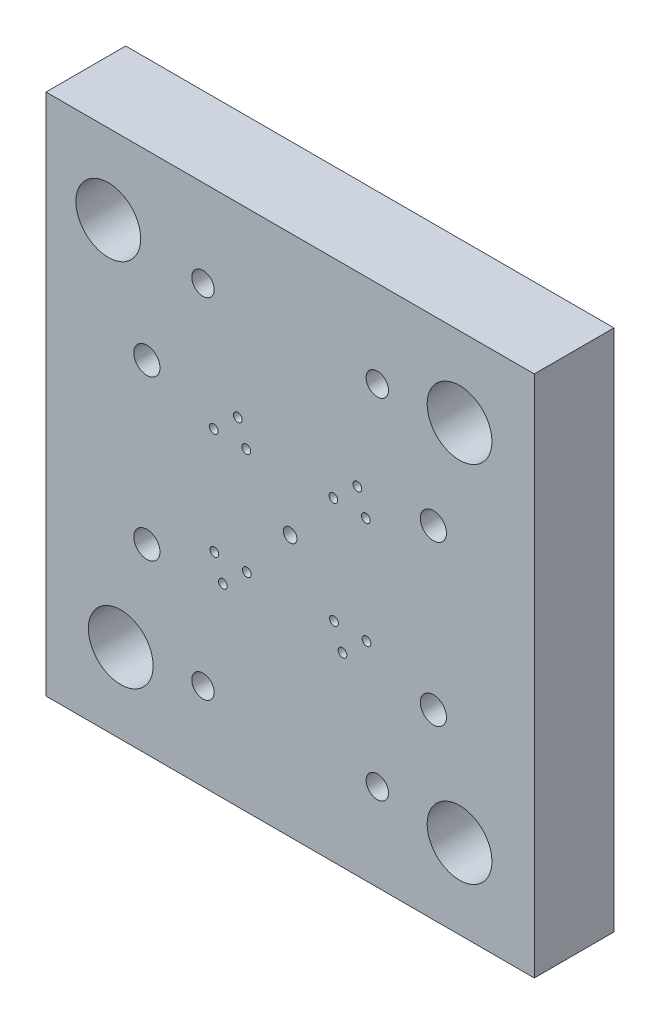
ISO-10303-21;
HEADER;
FILE_DESCRIPTION(('STEP AP214'),'2;1');
FILE_NAME('part.step','',(''),(''),'','','');
FILE_SCHEMA(('AUTOMOTIVE_DESIGN { 1 0 10303 214 1 1 1 1 }'));
ENDSEC;
DATA;
#1=APPLICATION_CONTEXT('core data for automotive mechanical design processes');
#2=APPLICATION_PROTOCOL_DEFINITION('international standard','automotive_design',2000,#1);
#3=PRODUCT_CONTEXT('',#1,'mechanical');
#4=PRODUCT('Part','Part','',(#3));
#5=PRODUCT_RELATED_PRODUCT_CATEGORY('part','',(#4));
#6=PRODUCT_DEFINITION_FORMATION('','',#4);
#7=PRODUCT_DEFINITION_CONTEXT('part definition',#1,'design');
#8=PRODUCT_DEFINITION('design','',#6,#7);
#9=PRODUCT_DEFINITION_SHAPE('','',#8);
#10=(LENGTH_UNIT() NAMED_UNIT(*) SI_UNIT(.MILLI.,.METRE.));
#11=(NAMED_UNIT(*) PLANE_ANGLE_UNIT() SI_UNIT($,.RADIAN.));
#12=(NAMED_UNIT(*) SI_UNIT($,.STERADIAN.) SOLID_ANGLE_UNIT());
#13=UNCERTAINTY_MEASURE_WITH_UNIT(LENGTH_MEASURE(1.E-05),#10,'distance_accuracy_value','');
#14=(GEOMETRIC_REPRESENTATION_CONTEXT(3) GLOBAL_UNCERTAINTY_ASSIGNED_CONTEXT((#13)) GLOBAL_UNIT_ASSIGNED_CONTEXT((#10,
#11,#12)) REPRESENTATION_CONTEXT('',''));
#15=CARTESIAN_POINT('',(0.,0.,0.));
#16=DIRECTION('',(0.,0.,1.));
#17=DIRECTION('',(1.,0.,0.));
#18=AXIS2_PLACEMENT_3D('',#15,#16,#17);
#19=CARTESIAN_POINT('',(0.,0.,32.));
#20=DIRECTION('',(1.,0.,0.));
#21=DIRECTION('',(0.,0.,-1.));
#22=AXIS2_PLACEMENT_3D('',#19,#20,#21);
#23=PLANE('',#22);
#24=DIRECTION('',(0.,-1.,0.));
#25=VECTOR('',#24,1.);
#26=CARTESIAN_POINT('',(0.,0.,0.));
#27=LINE('',#26,#25);
#28=CARTESIAN_POINT('',(0.,210.,0.));
#29=VERTEX_POINT('',#28);
#30=CARTESIAN_POINT('',(0.,0.,0.));
#31=VERTEX_POINT('',#30);
#32=EDGE_CURVE('E87',#29,#31,#27,.T.);
#33=ORIENTED_EDGE('',*,*,#32,.T.);
#34=DIRECTION('',(0.,0.,-1.));
#35=VECTOR('',#34,1.);
#36=CARTESIAN_POINT('',(0.,0.,32.));
#37=LINE('',#36,#35);
#38=CARTESIAN_POINT('',(0.,0.,32.));
#39=VERTEX_POINT('',#38);
#40=EDGE_CURVE('E13',#39,#31,#37,.T.);
#41=ORIENTED_EDGE('',*,*,#40,.F.);
#42=DIRECTION('',(0.,-1.,0.));
#43=VECTOR('',#42,1.);
#44=CARTESIAN_POINT('',(0.,0.,32.));
#45=LINE('',#44,#43);
#46=CARTESIAN_POINT('',(0.,210.,32.));
#47=VERTEX_POINT('',#46);
#48=EDGE_CURVE('E110',#47,#39,#45,.T.);
#49=ORIENTED_EDGE('',*,*,#48,.F.);
#50=DIRECTION('',(0.,0.,-1.));
#51=VECTOR('',#50,1.);
#52=CARTESIAN_POINT('',(0.,210.,32.));
#53=LINE('',#52,#51);
#54=EDGE_CURVE('E99',#47,#29,#53,.T.);
#55=ORIENTED_EDGE('',*,*,#54,.T.);
#56=EDGE_LOOP('',(#33,#41,#49,#55));
#57=FACE_BOUND('',#56,.T.);
#58=ADVANCED_FACE('F43',(#57),#23,.F.);
#59=CARTESIAN_POINT('',(0.,0.,32.));
#60=DIRECTION('',(0.,1.,0.));
#61=DIRECTION('',(0.,0.,1.));
#62=AXIS2_PLACEMENT_3D('',#59,#60,#61);
#63=PLANE('',#62);
#64=DIRECTION('',(1.,0.,0.));
#65=VECTOR('',#64,1.);
#66=CARTESIAN_POINT('',(0.,0.,0.));
#67=LINE('',#66,#65);
#68=CARTESIAN_POINT('',(196.,0.,0.));
#69=VERTEX_POINT('',#68);
#70=EDGE_CURVE('E83',#31,#69,#67,.T.);
#71=ORIENTED_EDGE('',*,*,#70,.T.);
#72=DIRECTION('',(0.,0.,-1.));
#73=VECTOR('',#72,1.);
#74=CARTESIAN_POINT('',(196.,0.,32.));
#75=LINE('',#74,#73);
#76=CARTESIAN_POINT('',(196.,0.,32.));
#77=VERTEX_POINT('',#76);
#78=EDGE_CURVE('E50',#77,#69,#75,.T.);
#79=ORIENTED_EDGE('',*,*,#78,.F.);
#80=DIRECTION('',(1.,0.,0.));
#81=VECTOR('',#80,1.);
#82=CARTESIAN_POINT('',(0.,0.,32.));
#83=LINE('',#82,#81);
#84=EDGE_CURVE('E95',#39,#77,#83,.T.);
#85=ORIENTED_EDGE('',*,*,#84,.F.);
#86=ORIENTED_EDGE('',*,*,#40,.T.);
#87=EDGE_LOOP('',(#71,#79,#85,#86));
#88=FACE_BOUND('',#87,.T.);
#89=ADVANCED_FACE('F94',(#88),#63,.F.);
#90=CARTESIAN_POINT('',(196.,0.,32.));
#91=DIRECTION('',(-1.,0.,0.));
#92=DIRECTION('',(0.,0.,1.));
#93=AXIS2_PLACEMENT_3D('',#90,#91,#92);
#94=PLANE('',#93);
#95=DIRECTION('',(0.,1.,0.));
#96=VECTOR('',#95,1.);
#97=CARTESIAN_POINT('',(196.,0.,0.));
#98=LINE('',#97,#96);
#99=CARTESIAN_POINT('',(196.,210.,0.));
#100=VERTEX_POINT('',#99);
#101=EDGE_CURVE('E88',#69,#100,#98,.T.);
#102=ORIENTED_EDGE('',*,*,#101,.T.);
#103=DIRECTION('',(0.,0.,-1.));
#104=VECTOR('',#103,1.);
#105=CARTESIAN_POINT('',(196.,210.,32.));
#106=LINE('',#105,#104);
#107=CARTESIAN_POINT('',(196.,210.,32.));
#108=VERTEX_POINT('',#107);
#109=EDGE_CURVE('E116',#108,#100,#106,.T.);
#110=ORIENTED_EDGE('',*,*,#109,.F.);
#111=DIRECTION('',(0.,1.,0.));
#112=VECTOR('',#111,1.);
#113=CARTESIAN_POINT('',(196.,0.,32.));
#114=LINE('',#113,#112);
#115=EDGE_CURVE('E62',#77,#108,#114,.T.);
#116=ORIENTED_EDGE('',*,*,#115,.F.);
#117=ORIENTED_EDGE('',*,*,#78,.T.);
#118=EDGE_LOOP('',(#102,#110,#116,#117));
#119=FACE_BOUND('',#118,.T.);
#120=ADVANCED_FACE('F119',(#119),#94,.F.);
#121=CARTESIAN_POINT('',(0.,210.,32.));
#122=DIRECTION('',(0.,-1.,0.));
#123=DIRECTION('',(1.,0.,0.));
#124=AXIS2_PLACEMENT_3D('',#121,#122,#123);
#125=PLANE('',#124);
#126=DIRECTION('',(-1.,0.,0.));
#127=VECTOR('',#126,1.);
#128=CARTESIAN_POINT('',(0.,210.,0.));
#129=LINE('',#128,#127);
#130=EDGE_CURVE('E108',#100,#29,#129,.T.);
#131=ORIENTED_EDGE('',*,*,#130,.T.);
#132=ORIENTED_EDGE('',*,*,#54,.F.);
#133=DIRECTION('',(-1.,0.,0.));
#134=VECTOR('',#133,1.);
#135=CARTESIAN_POINT('',(0.,210.,32.));
#136=LINE('',#135,#134);
#137=EDGE_CURVE('E57',#108,#47,#136,.T.);
#138=ORIENTED_EDGE('',*,*,#137,.F.);
#139=ORIENTED_EDGE('',*,*,#109,.T.);
#140=EDGE_LOOP('',(#131,#132,#138,#139));
#141=FACE_BOUND('',#140,.T.);
#142=ADVANCED_FACE('F121',(#141),#125,.F.);
#143=CARTESIAN_POINT('',(0.,0.,32.));
#144=DIRECTION('',(0.,0.,-1.));
#145=DIRECTION('',(-1.,0.,0.));
#146=AXIS2_PLACEMENT_3D('',#143,#144,#145);
#147=PLANE('',#146);
#148=CARTESIAN_POINT('',(133.,35.,32.));
#149=DIRECTION('',(0.,0.,-1.));
#150=DIRECTION('',(1.,0.,0.));
#151=AXIS2_PLACEMENT_3D('',#148,#149,#150);
#152=CIRCLE('',#151,4.49999999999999);
#153=CARTESIAN_POINT('',(137.5,35.,32.));
#154=VERTEX_POINT('',#153);
#155=EDGE_CURVE('E415',#154,#154,#152,.T.);
#156=ORIENTED_EDGE('',*,*,#155,.T.);
#157=EDGE_LOOP('',(#156));
#158=FACE_BOUND('',#157,.T.);
#159=CARTESIAN_POINT('',(133.,175.,32.));
#160=DIRECTION('',(0.,0.,-1.));
#161=DIRECTION('',(-1.,0.,0.));
#162=AXIS2_PLACEMENT_3D('',#159,#160,#161);
#163=CIRCLE('',#162,4.50000000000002);
#164=CARTESIAN_POINT('',(128.5,175.,32.));
#165=VERTEX_POINT('',#164);
#166=EDGE_CURVE('E425',#165,#165,#163,.T.);
#167=ORIENTED_EDGE('',*,*,#166,.T.);
#168=EDGE_LOOP('',(#167));
#169=FACE_BOUND('',#168,.T.);
#170=CARTESIAN_POINT('',(63.,175.,32.));
#171=DIRECTION('',(0.,0.,-1.));
#172=DIRECTION('',(1.,0.,0.));
#173=AXIS2_PLACEMENT_3D('',#170,#171,#172);
#174=CIRCLE('',#173,4.50000000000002);
#175=CARTESIAN_POINT('',(67.5,175.,32.));
#176=VERTEX_POINT('',#175);
#177=EDGE_CURVE('E431',#176,#176,#174,.T.);
#178=ORIENTED_EDGE('',*,*,#177,.T.);
#179=EDGE_LOOP('',(#178));
#180=FACE_BOUND('',#179,.T.);
#181=CARTESIAN_POINT('',(63.,35.,32.));
#182=DIRECTION('',(0.,0.,-1.));
#183=DIRECTION('',(-1.,0.,0.));
#184=AXIS2_PLACEMENT_3D('',#181,#182,#183);
#185=CIRCLE('',#184,4.50000000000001);
#186=CARTESIAN_POINT('',(58.5,35.,32.));
#187=VERTEX_POINT('',#186);
#188=EDGE_CURVE('E437',#187,#187,#185,.T.);
#189=ORIENTED_EDGE('',*,*,#188,.T.);
#190=EDGE_LOOP('',(#189));
#191=FACE_BOUND('',#190,.T.);
#192=CARTESIAN_POINT('',(115.36,126.58,32.));
#193=DIRECTION('',(0.,0.,-1.));
#194=DIRECTION('',(-1.,0.,0.));
#195=AXIS2_PLACEMENT_3D('',#192,#193,#194);
#196=CIRCLE('',#195,1.75);
#197=CARTESIAN_POINT('',(113.61,126.58,32.));
#198=VERTEX_POINT('',#197);
#199=EDGE_CURVE('E443',#198,#198,#196,.T.);
#200=ORIENTED_EDGE('',*,*,#199,.T.);
#201=EDGE_LOOP('',(#200));
#202=FACE_BOUND('',#201,.T.);
#203=CARTESIAN_POINT('',(128.41,126.07,32.));
#204=DIRECTION('',(0.,0.,-1.));
#205=DIRECTION('',(-1.,0.,0.));
#206=AXIS2_PLACEMENT_3D('',#203,#204,#205);
#207=CIRCLE('',#206,1.75000000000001);
#208=CARTESIAN_POINT('',(126.66,126.07,32.));
#209=VERTEX_POINT('',#208);
#210=EDGE_CURVE('E449',#209,#209,#207,.T.);
#211=ORIENTED_EDGE('',*,*,#210,.T.);
#212=EDGE_LOOP('',(#211));
#213=FACE_BOUND('',#212,.T.);
#214=CARTESIAN_POINT('',(124.99,135.41,32.));
#215=DIRECTION('',(0.,0.,-1.));
#216=DIRECTION('',(-1.,0.,0.));
#217=AXIS2_PLACEMENT_3D('',#214,#215,#216);
#218=CIRCLE('',#217,1.75);
#219=CARTESIAN_POINT('',(123.24,135.41,32.));
#220=VERTEX_POINT('',#219);
#221=EDGE_CURVE('E455',#220,#220,#218,.T.);
#222=ORIENTED_EDGE('',*,*,#221,.T.);
#223=EDGE_LOOP('',(#222));
#224=FACE_BOUND('',#223,.T.);
#225=CARTESIAN_POINT('',(119.01,74.59,32.));
#226=DIRECTION('',(0.,0.,-1.));
#227=DIRECTION('',(-1.,0.,0.));
#228=AXIS2_PLACEMENT_3D('',#225,#226,#227);
#229=CIRCLE('',#228,1.75);
#230=CARTESIAN_POINT('',(117.26,74.59,32.));
#231=VERTEX_POINT('',#230);
#232=EDGE_CURVE('E461',#231,#231,#229,.T.);
#233=ORIENTED_EDGE('',*,*,#232,.T.);
#234=EDGE_LOOP('',(#233));
#235=FACE_BOUND('',#234,.T.);
#236=CARTESIAN_POINT('',(115.59,83.93,32.));
#237=DIRECTION('',(0.,0.,-1.));
#238=DIRECTION('',(-1.,0.,0.));
#239=AXIS2_PLACEMENT_3D('',#236,#237,#238);
#240=CIRCLE('',#239,1.75);
#241=CARTESIAN_POINT('',(113.84,83.93,32.));
#242=VERTEX_POINT('',#241);
#243=EDGE_CURVE('E467',#242,#242,#240,.T.);
#244=ORIENTED_EDGE('',*,*,#243,.T.);
#245=EDGE_LOOP('',(#244));
#246=FACE_BOUND('',#245,.T.);
#247=CARTESIAN_POINT('',(128.64,83.42,32.));
#248=DIRECTION('',(0.,0.,-1.));
#249=DIRECTION('',(-1.,0.,0.));
#250=AXIS2_PLACEMENT_3D('',#247,#248,#249);
#251=CIRCLE('',#250,1.75000000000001);
#252=CARTESIAN_POINT('',(126.89,83.42,32.));
#253=VERTEX_POINT('',#252);
#254=EDGE_CURVE('E473',#253,#253,#251,.T.);
#255=ORIENTED_EDGE('',*,*,#254,.T.);
#256=EDGE_LOOP('',(#255));
#257=FACE_BOUND('',#256,.T.);
#258=CARTESIAN_POINT('',(80.64,83.42,32.));
#259=DIRECTION('',(0.,0.,-1.));
#260=DIRECTION('',(-1.,0.,0.));
#261=AXIS2_PLACEMENT_3D('',#258,#259,#260);
#262=CIRCLE('',#261,1.75);
#263=CARTESIAN_POINT('',(78.89,83.42,32.));
#264=VERTEX_POINT('',#263);
#265=EDGE_CURVE('E479',#264,#264,#262,.T.);
#266=ORIENTED_EDGE('',*,*,#265,.T.);
#267=EDGE_LOOP('',(#266));
#268=FACE_BOUND('',#267,.T.);
#269=CARTESIAN_POINT('',(71.01,74.59,32.));
#270=DIRECTION('',(0.,0.,-1.));
#271=DIRECTION('',(-1.,0.,0.));
#272=AXIS2_PLACEMENT_3D('',#269,#270,#271);
#273=CIRCLE('',#272,1.75);
#274=CARTESIAN_POINT('',(69.26,74.59,32.));
#275=VERTEX_POINT('',#274);
#276=EDGE_CURVE('E485',#275,#275,#273,.T.);
#277=ORIENTED_EDGE('',*,*,#276,.T.);
#278=EDGE_LOOP('',(#277));
#279=FACE_BOUND('',#278,.T.);
#280=CARTESIAN_POINT('',(67.59,83.93,32.));
#281=DIRECTION('',(0.,0.,-1.));
#282=DIRECTION('',(-1.,0.,0.));
#283=AXIS2_PLACEMENT_3D('',#280,#281,#282);
#284=CIRCLE('',#283,1.75);
#285=CARTESIAN_POINT('',(65.84,83.93,32.));
#286=VERTEX_POINT('',#285);
#287=EDGE_CURVE('E491',#286,#286,#284,.T.);
#288=ORIENTED_EDGE('',*,*,#287,.T.);
#289=EDGE_LOOP('',(#288));
#290=FACE_BOUND('',#289,.T.);
#291=CARTESIAN_POINT('',(76.99,135.41,32.));
#292=DIRECTION('',(0.,0.,-1.));
#293=DIRECTION('',(-1.,0.,0.));
#294=AXIS2_PLACEMENT_3D('',#291,#292,#293);
#295=CIRCLE('',#294,1.75000000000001);
#296=CARTESIAN_POINT('',(75.24,135.41,32.));
#297=VERTEX_POINT('',#296);
#298=EDGE_CURVE('E497',#297,#297,#295,.T.);
#299=ORIENTED_EDGE('',*,*,#298,.T.);
#300=EDGE_LOOP('',(#299));
#301=FACE_BOUND('',#300,.T.);
#302=CARTESIAN_POINT('',(80.41,126.07,32.));
#303=DIRECTION('',(0.,0.,-1.));
#304=DIRECTION('',(-1.,0.,0.));
#305=AXIS2_PLACEMENT_3D('',#302,#303,#304);
#306=CIRCLE('',#305,1.75);
#307=CARTESIAN_POINT('',(78.66,126.07,32.));
#308=VERTEX_POINT('',#307);
#309=EDGE_CURVE('E503',#308,#308,#306,.T.);
#310=ORIENTED_EDGE('',*,*,#309,.T.);
#311=EDGE_LOOP('',(#310));
#312=FACE_BOUND('',#311,.T.);
#313=CARTESIAN_POINT('',(67.36,126.58,32.));
#314=DIRECTION('',(0.,0.,-1.));
#315=DIRECTION('',(-1.,0.,0.));
#316=AXIS2_PLACEMENT_3D('',#313,#314,#315);
#317=CIRCLE('',#316,1.75);
#318=CARTESIAN_POINT('',(65.61,126.58,32.));
#319=VERTEX_POINT('',#318);
#320=EDGE_CURVE('E509',#319,#319,#317,.T.);
#321=ORIENTED_EDGE('',*,*,#320,.T.);
#322=EDGE_LOOP('',(#321));
#323=FACE_BOUND('',#322,.T.);
#324=CARTESIAN_POINT('',(98.,105.,32.));
#325=DIRECTION('',(0.,0.,-1.));
#326=DIRECTION('',(-1.,0.,0.));
#327=AXIS2_PLACEMENT_3D('',#324,#325,#326);
#328=CIRCLE('',#327,2.75000000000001);
#329=CARTESIAN_POINT('',(95.25,105.,32.));
#330=VERTEX_POINT('',#329);
#331=EDGE_CURVE('E515',#330,#330,#328,.T.);
#332=ORIENTED_EDGE('',*,*,#331,.T.);
#333=EDGE_LOOP('',(#332));
#334=FACE_BOUND('',#333,.T.);
#335=CARTESIAN_POINT('',(155.5,137.,32.));
#336=DIRECTION('',(0.,0.,-1.));
#337=DIRECTION('',(-1.,0.,0.));
#338=AXIS2_PLACEMENT_3D('',#335,#336,#337);
#339=CIRCLE('',#338,5.25);
#340=CARTESIAN_POINT('',(150.25,137.,32.));
#341=VERTEX_POINT('',#340);
#342=EDGE_CURVE('E521',#341,#341,#339,.T.);
#343=ORIENTED_EDGE('',*,*,#342,.T.);
#344=EDGE_LOOP('',(#343));
#345=FACE_BOUND('',#344,.T.);
#346=CARTESIAN_POINT('',(155.5,73.,32.));
#347=DIRECTION('',(0.,0.,-1.));
#348=DIRECTION('',(-1.,0.,0.));
#349=AXIS2_PLACEMENT_3D('',#346,#347,#348);
#350=CIRCLE('',#349,5.25);
#351=CARTESIAN_POINT('',(150.25,73.,32.));
#352=VERTEX_POINT('',#351);
#353=EDGE_CURVE('E527',#352,#352,#350,.T.);
#354=ORIENTED_EDGE('',*,*,#353,.T.);
#355=EDGE_LOOP('',(#354));
#356=FACE_BOUND('',#355,.T.);
#357=CARTESIAN_POINT('',(40.5,73.,32.));
#358=DIRECTION('',(0.,0.,-1.));
#359=DIRECTION('',(-1.,0.,0.));
#360=AXIS2_PLACEMENT_3D('',#357,#358,#359);
#361=CIRCLE('',#360,5.25);
#362=CARTESIAN_POINT('',(35.25,73.,32.));
#363=VERTEX_POINT('',#362);
#364=EDGE_CURVE('E533',#363,#363,#361,.T.);
#365=ORIENTED_EDGE('',*,*,#364,.T.);
#366=EDGE_LOOP('',(#365));
#367=FACE_BOUND('',#366,.T.);
#368=CARTESIAN_POINT('',(40.5,137.,32.));
#369=DIRECTION('',(0.,0.,-1.));
#370=DIRECTION('',(-1.,0.,0.));
#371=AXIS2_PLACEMENT_3D('',#368,#369,#370);
#372=CIRCLE('',#371,5.25);
#373=CARTESIAN_POINT('',(35.25,137.,32.));
#374=VERTEX_POINT('',#373);
#375=EDGE_CURVE('E539',#374,#374,#372,.T.);
#376=ORIENTED_EDGE('',*,*,#375,.T.);
#377=EDGE_LOOP('',(#376));
#378=FACE_BOUND('',#377,.T.);
#379=CARTESIAN_POINT('',(30.,32.,32.));
#380=DIRECTION('',(0.,0.,-1.));
#381=DIRECTION('',(-1.,0.,0.));
#382=AXIS2_PLACEMENT_3D('',#379,#380,#381);
#383=CIRCLE('',#382,13.);
#384=CARTESIAN_POINT('',(17.,32.,32.));
#385=VERTEX_POINT('',#384);
#386=EDGE_CURVE('E545',#385,#385,#383,.T.);
#387=ORIENTED_EDGE('',*,*,#386,.T.);
#388=EDGE_LOOP('',(#387));
#389=FACE_BOUND('',#388,.T.);
#390=CARTESIAN_POINT('',(166.,32.,32.));
#391=DIRECTION('',(0.,0.,-1.));
#392=DIRECTION('',(-1.,0.,0.));
#393=AXIS2_PLACEMENT_3D('',#390,#391,#392);
#394=CIRCLE('',#393,13.);
#395=CARTESIAN_POINT('',(153.,32.,32.));
#396=VERTEX_POINT('',#395);
#397=EDGE_CURVE('E551',#396,#396,#394,.T.);
#398=ORIENTED_EDGE('',*,*,#397,.T.);
#399=EDGE_LOOP('',(#398));
#400=FACE_BOUND('',#399,.T.);
#401=CARTESIAN_POINT('',(166.,178.,32.));
#402=DIRECTION('',(0.,0.,-1.));
#403=DIRECTION('',(-1.,0.,0.));
#404=AXIS2_PLACEMENT_3D('',#401,#402,#403);
#405=CIRCLE('',#404,13.);
#406=CARTESIAN_POINT('',(153.,178.,32.));
#407=VERTEX_POINT('',#406);
#408=EDGE_CURVE('E557',#407,#407,#405,.T.);
#409=ORIENTED_EDGE('',*,*,#408,.T.);
#410=EDGE_LOOP('',(#409));
#411=FACE_BOUND('',#410,.T.);
#412=CARTESIAN_POINT('',(25.,178.,32.));
#413=DIRECTION('',(0.,0.,-1.));
#414=DIRECTION('',(-1.,0.,0.));
#415=AXIS2_PLACEMENT_3D('',#412,#413,#414);
#416=CIRCLE('',#415,13.);
#417=CARTESIAN_POINT('',(12.,178.,32.));
#418=VERTEX_POINT('',#417);
#419=EDGE_CURVE('E100',#418,#418,#416,.T.);
#420=ORIENTED_EDGE('',*,*,#419,.T.);
#421=EDGE_LOOP('',(#420));
#422=FACE_BOUND('',#421,.T.);
#423=ORIENTED_EDGE('',*,*,#48,.T.);
#424=ORIENTED_EDGE('',*,*,#84,.T.);
#425=ORIENTED_EDGE('',*,*,#115,.T.);
#426=ORIENTED_EDGE('',*,*,#137,.T.);
#427=EDGE_LOOP('',(#423,#424,#425,#426));
#428=FACE_BOUND('',#427,.T.);
#429=ADVANCED_FACE('F122',(#158,#169,#180,#191,#202,#213,#224,#235,#246,#257,#268,#279,#290,
#301,#312,#323,#334,#345,#356,#367,#378,#389,#400,#411,#422,#428),#147,.F.);
#430=CARTESIAN_POINT('',(0.,0.,0.));
#431=DIRECTION('',(0.,0.,-1.));
#432=DIRECTION('',(-1.,0.,0.));
#433=AXIS2_PLACEMENT_3D('',#430,#431,#432);
#434=PLANE('',#433);
#435=CARTESIAN_POINT('',(133.,35.,0.));
#436=DIRECTION('',(0.,0.,-1.));
#437=DIRECTION('',(1.,0.,0.));
#438=AXIS2_PLACEMENT_3D('',#435,#436,#437);
#439=CIRCLE('',#438,4.49999999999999);
#440=CARTESIAN_POINT('',(137.5,35.,0.));
#441=VERTEX_POINT('',#440);
#442=EDGE_CURVE('E418',#441,#441,#439,.T.);
#443=ORIENTED_EDGE('',*,*,#442,.F.);
#444=EDGE_LOOP('',(#443));
#445=FACE_BOUND('',#444,.T.);
#446=CARTESIAN_POINT('',(133.,175.,0.));
#447=DIRECTION('',(0.,0.,-1.));
#448=DIRECTION('',(-1.,0.,0.));
#449=AXIS2_PLACEMENT_3D('',#446,#447,#448);
#450=CIRCLE('',#449,4.50000000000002);
#451=CARTESIAN_POINT('',(128.5,175.,0.));
#452=VERTEX_POINT('',#451);
#453=EDGE_CURVE('E420',#452,#452,#450,.T.);
#454=ORIENTED_EDGE('',*,*,#453,.F.);
#455=EDGE_LOOP('',(#454));
#456=FACE_BOUND('',#455,.T.);
#457=CARTESIAN_POINT('',(63.,175.,0.));
#458=DIRECTION('',(0.,0.,-1.));
#459=DIRECTION('',(1.,0.,0.));
#460=AXIS2_PLACEMENT_3D('',#457,#458,#459);
#461=CIRCLE('',#460,4.50000000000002);
#462=CARTESIAN_POINT('',(67.5,175.,0.));
#463=VERTEX_POINT('',#462);
#464=EDGE_CURVE('E428',#463,#463,#461,.T.);
#465=ORIENTED_EDGE('',*,*,#464,.F.);
#466=EDGE_LOOP('',(#465));
#467=FACE_BOUND('',#466,.T.);
#468=CARTESIAN_POINT('',(63.,35.,0.));
#469=DIRECTION('',(0.,0.,-1.));
#470=DIRECTION('',(-1.,0.,0.));
#471=AXIS2_PLACEMENT_3D('',#468,#469,#470);
#472=CIRCLE('',#471,4.50000000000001);
#473=CARTESIAN_POINT('',(58.5,35.,0.));
#474=VERTEX_POINT('',#473);
#475=EDGE_CURVE('E434',#474,#474,#472,.T.);
#476=ORIENTED_EDGE('',*,*,#475,.F.);
#477=EDGE_LOOP('',(#476));
#478=FACE_BOUND('',#477,.T.);
#479=CARTESIAN_POINT('',(115.36,126.58,0.));
#480=DIRECTION('',(0.,0.,-1.));
#481=DIRECTION('',(-1.,0.,0.));
#482=AXIS2_PLACEMENT_3D('',#479,#480,#481);
#483=CIRCLE('',#482,1.75);
#484=CARTESIAN_POINT('',(113.61,126.58,0.));
#485=VERTEX_POINT('',#484);
#486=EDGE_CURVE('E440',#485,#485,#483,.T.);
#487=ORIENTED_EDGE('',*,*,#486,.F.);
#488=EDGE_LOOP('',(#487));
#489=FACE_BOUND('',#488,.T.);
#490=CARTESIAN_POINT('',(128.41,126.07,0.));
#491=DIRECTION('',(0.,0.,-1.));
#492=DIRECTION('',(-1.,0.,0.));
#493=AXIS2_PLACEMENT_3D('',#490,#491,#492);
#494=CIRCLE('',#493,1.75000000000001);
#495=CARTESIAN_POINT('',(126.66,126.07,0.));
#496=VERTEX_POINT('',#495);
#497=EDGE_CURVE('E446',#496,#496,#494,.T.);
#498=ORIENTED_EDGE('',*,*,#497,.F.);
#499=EDGE_LOOP('',(#498));
#500=FACE_BOUND('',#499,.T.);
#501=CARTESIAN_POINT('',(124.99,135.41,0.));
#502=DIRECTION('',(0.,0.,-1.));
#503=DIRECTION('',(-1.,0.,0.));
#504=AXIS2_PLACEMENT_3D('',#501,#502,#503);
#505=CIRCLE('',#504,1.75);
#506=CARTESIAN_POINT('',(123.24,135.41,0.));
#507=VERTEX_POINT('',#506);
#508=EDGE_CURVE('E452',#507,#507,#505,.T.);
#509=ORIENTED_EDGE('',*,*,#508,.F.);
#510=EDGE_LOOP('',(#509));
#511=FACE_BOUND('',#510,.T.);
#512=CARTESIAN_POINT('',(119.01,74.59,0.));
#513=DIRECTION('',(0.,0.,-1.));
#514=DIRECTION('',(-1.,0.,0.));
#515=AXIS2_PLACEMENT_3D('',#512,#513,#514);
#516=CIRCLE('',#515,1.75);
#517=CARTESIAN_POINT('',(117.26,74.59,0.));
#518=VERTEX_POINT('',#517);
#519=EDGE_CURVE('E458',#518,#518,#516,.T.);
#520=ORIENTED_EDGE('',*,*,#519,.F.);
#521=EDGE_LOOP('',(#520));
#522=FACE_BOUND('',#521,.T.);
#523=CARTESIAN_POINT('',(115.59,83.93,0.));
#524=DIRECTION('',(0.,0.,-1.));
#525=DIRECTION('',(-1.,0.,0.));
#526=AXIS2_PLACEMENT_3D('',#523,#524,#525);
#527=CIRCLE('',#526,1.75);
#528=CARTESIAN_POINT('',(113.84,83.93,0.));
#529=VERTEX_POINT('',#528);
#530=EDGE_CURVE('E464',#529,#529,#527,.T.);
#531=ORIENTED_EDGE('',*,*,#530,.F.);
#532=EDGE_LOOP('',(#531));
#533=FACE_BOUND('',#532,.T.);
#534=CARTESIAN_POINT('',(128.64,83.42,0.));
#535=DIRECTION('',(0.,0.,-1.));
#536=DIRECTION('',(-1.,0.,0.));
#537=AXIS2_PLACEMENT_3D('',#534,#535,#536);
#538=CIRCLE('',#537,1.75000000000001);
#539=CARTESIAN_POINT('',(126.89,83.42,0.));
#540=VERTEX_POINT('',#539);
#541=EDGE_CURVE('E470',#540,#540,#538,.T.);
#542=ORIENTED_EDGE('',*,*,#541,.F.);
#543=EDGE_LOOP('',(#542));
#544=FACE_BOUND('',#543,.T.);
#545=CARTESIAN_POINT('',(80.64,83.42,0.));
#546=DIRECTION('',(0.,0.,-1.));
#547=DIRECTION('',(-1.,0.,0.));
#548=AXIS2_PLACEMENT_3D('',#545,#546,#547);
#549=CIRCLE('',#548,1.75);
#550=CARTESIAN_POINT('',(78.89,83.42,0.));
#551=VERTEX_POINT('',#550);
#552=EDGE_CURVE('E476',#551,#551,#549,.T.);
#553=ORIENTED_EDGE('',*,*,#552,.F.);
#554=EDGE_LOOP('',(#553));
#555=FACE_BOUND('',#554,.T.);
#556=CARTESIAN_POINT('',(71.01,74.59,0.));
#557=DIRECTION('',(0.,0.,-1.));
#558=DIRECTION('',(-1.,0.,0.));
#559=AXIS2_PLACEMENT_3D('',#556,#557,#558);
#560=CIRCLE('',#559,1.75);
#561=CARTESIAN_POINT('',(69.26,74.59,0.));
#562=VERTEX_POINT('',#561);
#563=EDGE_CURVE('E482',#562,#562,#560,.T.);
#564=ORIENTED_EDGE('',*,*,#563,.F.);
#565=EDGE_LOOP('',(#564));
#566=FACE_BOUND('',#565,.T.);
#567=CARTESIAN_POINT('',(67.59,83.93,0.));
#568=DIRECTION('',(0.,0.,-1.));
#569=DIRECTION('',(-1.,0.,0.));
#570=AXIS2_PLACEMENT_3D('',#567,#568,#569);
#571=CIRCLE('',#570,1.75);
#572=CARTESIAN_POINT('',(65.84,83.93,0.));
#573=VERTEX_POINT('',#572);
#574=EDGE_CURVE('E488',#573,#573,#571,.T.);
#575=ORIENTED_EDGE('',*,*,#574,.F.);
#576=EDGE_LOOP('',(#575));
#577=FACE_BOUND('',#576,.T.);
#578=CARTESIAN_POINT('',(76.99,135.41,0.));
#579=DIRECTION('',(0.,0.,-1.));
#580=DIRECTION('',(-1.,0.,0.));
#581=AXIS2_PLACEMENT_3D('',#578,#579,#580);
#582=CIRCLE('',#581,1.75000000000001);
#583=CARTESIAN_POINT('',(75.24,135.41,0.));
#584=VERTEX_POINT('',#583);
#585=EDGE_CURVE('E494',#584,#584,#582,.T.);
#586=ORIENTED_EDGE('',*,*,#585,.F.);
#587=EDGE_LOOP('',(#586));
#588=FACE_BOUND('',#587,.T.);
#589=CARTESIAN_POINT('',(80.41,126.07,0.));
#590=DIRECTION('',(0.,0.,-1.));
#591=DIRECTION('',(-1.,0.,0.));
#592=AXIS2_PLACEMENT_3D('',#589,#590,#591);
#593=CIRCLE('',#592,1.75);
#594=CARTESIAN_POINT('',(78.66,126.07,0.));
#595=VERTEX_POINT('',#594);
#596=EDGE_CURVE('E500',#595,#595,#593,.T.);
#597=ORIENTED_EDGE('',*,*,#596,.F.);
#598=EDGE_LOOP('',(#597));
#599=FACE_BOUND('',#598,.T.);
#600=CARTESIAN_POINT('',(67.36,126.58,0.));
#601=DIRECTION('',(0.,0.,-1.));
#602=DIRECTION('',(-1.,0.,0.));
#603=AXIS2_PLACEMENT_3D('',#600,#601,#602);
#604=CIRCLE('',#603,1.75);
#605=CARTESIAN_POINT('',(65.61,126.58,0.));
#606=VERTEX_POINT('',#605);
#607=EDGE_CURVE('E506',#606,#606,#604,.T.);
#608=ORIENTED_EDGE('',*,*,#607,.F.);
#609=EDGE_LOOP('',(#608));
#610=FACE_BOUND('',#609,.T.);
#611=CARTESIAN_POINT('',(98.,105.,0.));
#612=DIRECTION('',(0.,0.,-1.));
#613=DIRECTION('',(-1.,0.,0.));
#614=AXIS2_PLACEMENT_3D('',#611,#612,#613);
#615=CIRCLE('',#614,2.75000000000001);
#616=CARTESIAN_POINT('',(95.25,105.,0.));
#617=VERTEX_POINT('',#616);
#618=EDGE_CURVE('E512',#617,#617,#615,.T.);
#619=ORIENTED_EDGE('',*,*,#618,.F.);
#620=EDGE_LOOP('',(#619));
#621=FACE_BOUND('',#620,.T.);
#622=CARTESIAN_POINT('',(155.5,137.,0.));
#623=DIRECTION('',(0.,0.,-1.));
#624=DIRECTION('',(-1.,0.,0.));
#625=AXIS2_PLACEMENT_3D('',#622,#623,#624);
#626=CIRCLE('',#625,5.25);
#627=CARTESIAN_POINT('',(150.25,137.,0.));
#628=VERTEX_POINT('',#627);
#629=EDGE_CURVE('E518',#628,#628,#626,.T.);
#630=ORIENTED_EDGE('',*,*,#629,.F.);
#631=EDGE_LOOP('',(#630));
#632=FACE_BOUND('',#631,.T.);
#633=CARTESIAN_POINT('',(155.5,73.,0.));
#634=DIRECTION('',(0.,0.,-1.));
#635=DIRECTION('',(-1.,0.,0.));
#636=AXIS2_PLACEMENT_3D('',#633,#634,#635);
#637=CIRCLE('',#636,5.25);
#638=CARTESIAN_POINT('',(150.25,73.,0.));
#639=VERTEX_POINT('',#638);
#640=EDGE_CURVE('E524',#639,#639,#637,.T.);
#641=ORIENTED_EDGE('',*,*,#640,.F.);
#642=EDGE_LOOP('',(#641));
#643=FACE_BOUND('',#642,.T.);
#644=CARTESIAN_POINT('',(40.5,73.,0.));
#645=DIRECTION('',(0.,0.,-1.));
#646=DIRECTION('',(-1.,0.,0.));
#647=AXIS2_PLACEMENT_3D('',#644,#645,#646);
#648=CIRCLE('',#647,5.25);
#649=CARTESIAN_POINT('',(35.25,73.,0.));
#650=VERTEX_POINT('',#649);
#651=EDGE_CURVE('E530',#650,#650,#648,.T.);
#652=ORIENTED_EDGE('',*,*,#651,.F.);
#653=EDGE_LOOP('',(#652));
#654=FACE_BOUND('',#653,.T.);
#655=CARTESIAN_POINT('',(40.5,137.,0.));
#656=DIRECTION('',(0.,0.,-1.));
#657=DIRECTION('',(-1.,0.,0.));
#658=AXIS2_PLACEMENT_3D('',#655,#656,#657);
#659=CIRCLE('',#658,5.25);
#660=CARTESIAN_POINT('',(35.25,137.,0.));
#661=VERTEX_POINT('',#660);
#662=EDGE_CURVE('E536',#661,#661,#659,.T.);
#663=ORIENTED_EDGE('',*,*,#662,.F.);
#664=EDGE_LOOP('',(#663));
#665=FACE_BOUND('',#664,.T.);
#666=CARTESIAN_POINT('',(30.,32.,0.));
#667=DIRECTION('',(0.,0.,-1.));
#668=DIRECTION('',(-1.,0.,0.));
#669=AXIS2_PLACEMENT_3D('',#666,#667,#668);
#670=CIRCLE('',#669,13.);
#671=CARTESIAN_POINT('',(17.,32.,0.));
#672=VERTEX_POINT('',#671);
#673=EDGE_CURVE('E542',#672,#672,#670,.T.);
#674=ORIENTED_EDGE('',*,*,#673,.F.);
#675=EDGE_LOOP('',(#674));
#676=FACE_BOUND('',#675,.T.);
#677=CARTESIAN_POINT('',(166.,32.,0.));
#678=DIRECTION('',(0.,0.,-1.));
#679=DIRECTION('',(-1.,0.,0.));
#680=AXIS2_PLACEMENT_3D('',#677,#678,#679);
#681=CIRCLE('',#680,13.);
#682=CARTESIAN_POINT('',(153.,32.,0.));
#683=VERTEX_POINT('',#682);
#684=EDGE_CURVE('E548',#683,#683,#681,.T.);
#685=ORIENTED_EDGE('',*,*,#684,.F.);
#686=EDGE_LOOP('',(#685));
#687=FACE_BOUND('',#686,.T.);
#688=CARTESIAN_POINT('',(166.,178.,0.));
#689=DIRECTION('',(0.,0.,-1.));
#690=DIRECTION('',(-1.,0.,0.));
#691=AXIS2_PLACEMENT_3D('',#688,#689,#690);
#692=CIRCLE('',#691,13.);
#693=CARTESIAN_POINT('',(153.,178.,0.));
#694=VERTEX_POINT('',#693);
#695=EDGE_CURVE('E554',#694,#694,#692,.T.);
#696=ORIENTED_EDGE('',*,*,#695,.F.);
#697=EDGE_LOOP('',(#696));
#698=FACE_BOUND('',#697,.T.);
#699=CARTESIAN_POINT('',(25.,178.,0.));
#700=DIRECTION('',(0.,0.,-1.));
#701=DIRECTION('',(-1.,0.,0.));
#702=AXIS2_PLACEMENT_3D('',#699,#700,#701);
#703=CIRCLE('',#702,13.);
#704=CARTESIAN_POINT('',(12.,178.,0.));
#705=VERTEX_POINT('',#704);
#706=EDGE_CURVE('E103',#705,#705,#703,.T.);
#707=ORIENTED_EDGE('',*,*,#706,.F.);
#708=EDGE_LOOP('',(#707));
#709=FACE_BOUND('',#708,.T.);
#710=ORIENTED_EDGE('',*,*,#32,.F.);
#711=ORIENTED_EDGE('',*,*,#130,.F.);
#712=ORIENTED_EDGE('',*,*,#101,.F.);
#713=ORIENTED_EDGE('',*,*,#70,.F.);
#714=EDGE_LOOP('',(#710,#711,#712,#713));
#715=FACE_BOUND('',#714,.T.);
#716=ADVANCED_FACE('F84',(#445,#456,#467,#478,#489,#500,#511,#522,#533,#544,#555,#566,#577,#588,
#599,#610,#621,#632,#643,#654,#665,#676,#687,#698,#709,#715),#434,.T.);
#717=CARTESIAN_POINT('',(25.,178.,32.));
#718=DIRECTION('',(0.,0.,-1.));
#719=DIRECTION('',(-1.,0.,0.));
#720=AXIS2_PLACEMENT_3D('',#717,#718,#719);
#721=CYLINDRICAL_SURFACE('',#720,13.);
#722=ORIENTED_EDGE('',*,*,#419,.F.);
#723=EDGE_LOOP('',(#722));
#724=FACE_BOUND('',#723,.T.);
#725=ORIENTED_EDGE('',*,*,#706,.T.);
#726=EDGE_LOOP('',(#725));
#727=FACE_BOUND('',#726,.T.);
#728=ADVANCED_FACE('F130',(#724,#727),#721,.F.);
#729=CARTESIAN_POINT('',(166.,178.,32.));
#730=DIRECTION('',(0.,0.,-1.));
#731=DIRECTION('',(-1.,0.,0.));
#732=AXIS2_PLACEMENT_3D('',#729,#730,#731);
#733=CYLINDRICAL_SURFACE('',#732,13.);
#734=ORIENTED_EDGE('',*,*,#408,.F.);
#735=EDGE_LOOP('',(#734));
#736=FACE_BOUND('',#735,.T.);
#737=ORIENTED_EDGE('',*,*,#695,.T.);
#738=EDGE_LOOP('',(#737));
#739=FACE_BOUND('',#738,.T.);
#740=ADVANCED_FACE('F169',(#736,#739),#733,.F.);
#741=CARTESIAN_POINT('',(166.,32.,32.));
#742=DIRECTION('',(0.,0.,-1.));
#743=DIRECTION('',(-1.,0.,0.));
#744=AXIS2_PLACEMENT_3D('',#741,#742,#743);
#745=CYLINDRICAL_SURFACE('',#744,13.);
#746=ORIENTED_EDGE('',*,*,#397,.F.);
#747=EDGE_LOOP('',(#746));
#748=FACE_BOUND('',#747,.T.);
#749=ORIENTED_EDGE('',*,*,#684,.T.);
#750=EDGE_LOOP('',(#749));
#751=FACE_BOUND('',#750,.T.);
#752=ADVANCED_FACE('F179',(#748,#751),#745,.F.);
#753=CARTESIAN_POINT('',(30.,32.,32.));
#754=DIRECTION('',(0.,0.,-1.));
#755=DIRECTION('',(-1.,0.,0.));
#756=AXIS2_PLACEMENT_3D('',#753,#754,#755);
#757=CYLINDRICAL_SURFACE('',#756,13.);
#758=ORIENTED_EDGE('',*,*,#386,.F.);
#759=EDGE_LOOP('',(#758));
#760=FACE_BOUND('',#759,.T.);
#761=ORIENTED_EDGE('',*,*,#673,.T.);
#762=EDGE_LOOP('',(#761));
#763=FACE_BOUND('',#762,.T.);
#764=ADVANCED_FACE('F189',(#760,#763),#757,.F.);
#765=CARTESIAN_POINT('',(40.5,137.,32.));
#766=DIRECTION('',(0.,0.,-1.));
#767=DIRECTION('',(-1.,0.,0.));
#768=AXIS2_PLACEMENT_3D('',#765,#766,#767);
#769=CYLINDRICAL_SURFACE('',#768,5.25);
#770=ORIENTED_EDGE('',*,*,#375,.F.);
#771=EDGE_LOOP('',(#770));
#772=FACE_BOUND('',#771,.T.);
#773=ORIENTED_EDGE('',*,*,#662,.T.);
#774=EDGE_LOOP('',(#773));
#775=FACE_BOUND('',#774,.T.);
#776=ADVANCED_FACE('F199',(#772,#775),#769,.F.);
#777=CARTESIAN_POINT('',(40.5,73.,32.));
#778=DIRECTION('',(0.,0.,-1.));
#779=DIRECTION('',(-1.,0.,0.));
#780=AXIS2_PLACEMENT_3D('',#777,#778,#779);
#781=CYLINDRICAL_SURFACE('',#780,5.25);
#782=ORIENTED_EDGE('',*,*,#364,.F.);
#783=EDGE_LOOP('',(#782));
#784=FACE_BOUND('',#783,.T.);
#785=ORIENTED_EDGE('',*,*,#651,.T.);
#786=EDGE_LOOP('',(#785));
#787=FACE_BOUND('',#786,.T.);
#788=ADVANCED_FACE('F209',(#784,#787),#781,.F.);
#789=CARTESIAN_POINT('',(155.5,73.,32.));
#790=DIRECTION('',(0.,0.,-1.));
#791=DIRECTION('',(-1.,0.,0.));
#792=AXIS2_PLACEMENT_3D('',#789,#790,#791);
#793=CYLINDRICAL_SURFACE('',#792,5.25);
#794=ORIENTED_EDGE('',*,*,#353,.F.);
#795=EDGE_LOOP('',(#794));
#796=FACE_BOUND('',#795,.T.);
#797=ORIENTED_EDGE('',*,*,#640,.T.);
#798=EDGE_LOOP('',(#797));
#799=FACE_BOUND('',#798,.T.);
#800=ADVANCED_FACE('F219',(#796,#799),#793,.F.);
#801=CARTESIAN_POINT('',(155.5,137.,32.));
#802=DIRECTION('',(0.,0.,-1.));
#803=DIRECTION('',(-1.,0.,0.));
#804=AXIS2_PLACEMENT_3D('',#801,#802,#803);
#805=CYLINDRICAL_SURFACE('',#804,5.25);
#806=ORIENTED_EDGE('',*,*,#342,.F.);
#807=EDGE_LOOP('',(#806));
#808=FACE_BOUND('',#807,.T.);
#809=ORIENTED_EDGE('',*,*,#629,.T.);
#810=EDGE_LOOP('',(#809));
#811=FACE_BOUND('',#810,.T.);
#812=ADVANCED_FACE('F229',(#808,#811),#805,.F.);
#813=CARTESIAN_POINT('',(98.,105.,32.));
#814=DIRECTION('',(0.,0.,-1.));
#815=DIRECTION('',(-1.,0.,0.));
#816=AXIS2_PLACEMENT_3D('',#813,#814,#815);
#817=CYLINDRICAL_SURFACE('',#816,2.75000000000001);
#818=ORIENTED_EDGE('',*,*,#331,.F.);
#819=EDGE_LOOP('',(#818));
#820=FACE_BOUND('',#819,.T.);
#821=ORIENTED_EDGE('',*,*,#618,.T.);
#822=EDGE_LOOP('',(#821));
#823=FACE_BOUND('',#822,.T.);
#824=ADVANCED_FACE('F239',(#820,#823),#817,.F.);
#825=CARTESIAN_POINT('',(67.36,126.58,32.));
#826=DIRECTION('',(0.,0.,-1.));
#827=DIRECTION('',(-1.,0.,0.));
#828=AXIS2_PLACEMENT_3D('',#825,#826,#827);
#829=CYLINDRICAL_SURFACE('',#828,1.75);
#830=ORIENTED_EDGE('',*,*,#320,.F.);
#831=EDGE_LOOP('',(#830));
#832=FACE_BOUND('',#831,.T.);
#833=ORIENTED_EDGE('',*,*,#607,.T.);
#834=EDGE_LOOP('',(#833));
#835=FACE_BOUND('',#834,.T.);
#836=ADVANCED_FACE('F249',(#832,#835),#829,.F.);
#837=CARTESIAN_POINT('',(80.41,126.07,32.));
#838=DIRECTION('',(0.,0.,-1.));
#839=DIRECTION('',(-1.,0.,0.));
#840=AXIS2_PLACEMENT_3D('',#837,#838,#839);
#841=CYLINDRICAL_SURFACE('',#840,1.75);
#842=ORIENTED_EDGE('',*,*,#309,.F.);
#843=EDGE_LOOP('',(#842));
#844=FACE_BOUND('',#843,.T.);
#845=ORIENTED_EDGE('',*,*,#596,.T.);
#846=EDGE_LOOP('',(#845));
#847=FACE_BOUND('',#846,.T.);
#848=ADVANCED_FACE('F259',(#844,#847),#841,.F.);
#849=CARTESIAN_POINT('',(76.99,135.41,32.));
#850=DIRECTION('',(0.,0.,-1.));
#851=DIRECTION('',(-1.,0.,0.));
#852=AXIS2_PLACEMENT_3D('',#849,#850,#851);
#853=CYLINDRICAL_SURFACE('',#852,1.75000000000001);
#854=ORIENTED_EDGE('',*,*,#298,.F.);
#855=EDGE_LOOP('',(#854));
#856=FACE_BOUND('',#855,.T.);
#857=ORIENTED_EDGE('',*,*,#585,.T.);
#858=EDGE_LOOP('',(#857));
#859=FACE_BOUND('',#858,.T.);
#860=ADVANCED_FACE('F269',(#856,#859),#853,.F.);
#861=CARTESIAN_POINT('',(67.59,83.93,32.));
#862=DIRECTION('',(0.,0.,-1.));
#863=DIRECTION('',(-1.,0.,0.));
#864=AXIS2_PLACEMENT_3D('',#861,#862,#863);
#865=CYLINDRICAL_SURFACE('',#864,1.75);
#866=ORIENTED_EDGE('',*,*,#287,.F.);
#867=EDGE_LOOP('',(#866));
#868=FACE_BOUND('',#867,.T.);
#869=ORIENTED_EDGE('',*,*,#574,.T.);
#870=EDGE_LOOP('',(#869));
#871=FACE_BOUND('',#870,.T.);
#872=ADVANCED_FACE('F279',(#868,#871),#865,.F.);
#873=CARTESIAN_POINT('',(71.01,74.59,32.));
#874=DIRECTION('',(0.,0.,-1.));
#875=DIRECTION('',(-1.,0.,0.));
#876=AXIS2_PLACEMENT_3D('',#873,#874,#875);
#877=CYLINDRICAL_SURFACE('',#876,1.75);
#878=ORIENTED_EDGE('',*,*,#276,.F.);
#879=EDGE_LOOP('',(#878));
#880=FACE_BOUND('',#879,.T.);
#881=ORIENTED_EDGE('',*,*,#563,.T.);
#882=EDGE_LOOP('',(#881));
#883=FACE_BOUND('',#882,.T.);
#884=ADVANCED_FACE('F289',(#880,#883),#877,.F.);
#885=CARTESIAN_POINT('',(80.64,83.42,32.));
#886=DIRECTION('',(0.,0.,-1.));
#887=DIRECTION('',(-1.,0.,0.));
#888=AXIS2_PLACEMENT_3D('',#885,#886,#887);
#889=CYLINDRICAL_SURFACE('',#888,1.75);
#890=ORIENTED_EDGE('',*,*,#265,.F.);
#891=EDGE_LOOP('',(#890));
#892=FACE_BOUND('',#891,.T.);
#893=ORIENTED_EDGE('',*,*,#552,.T.);
#894=EDGE_LOOP('',(#893));
#895=FACE_BOUND('',#894,.T.);
#896=ADVANCED_FACE('F299',(#892,#895),#889,.F.);
#897=CARTESIAN_POINT('',(128.64,83.42,32.));
#898=DIRECTION('',(0.,0.,-1.));
#899=DIRECTION('',(-1.,0.,0.));
#900=AXIS2_PLACEMENT_3D('',#897,#898,#899);
#901=CYLINDRICAL_SURFACE('',#900,1.75000000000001);
#902=ORIENTED_EDGE('',*,*,#254,.F.);
#903=EDGE_LOOP('',(#902));
#904=FACE_BOUND('',#903,.T.);
#905=ORIENTED_EDGE('',*,*,#541,.T.);
#906=EDGE_LOOP('',(#905));
#907=FACE_BOUND('',#906,.T.);
#908=ADVANCED_FACE('F309',(#904,#907),#901,.F.);
#909=CARTESIAN_POINT('',(115.59,83.93,32.));
#910=DIRECTION('',(0.,0.,-1.));
#911=DIRECTION('',(-1.,0.,0.));
#912=AXIS2_PLACEMENT_3D('',#909,#910,#911);
#913=CYLINDRICAL_SURFACE('',#912,1.75);
#914=ORIENTED_EDGE('',*,*,#243,.F.);
#915=EDGE_LOOP('',(#914));
#916=FACE_BOUND('',#915,.T.);
#917=ORIENTED_EDGE('',*,*,#530,.T.);
#918=EDGE_LOOP('',(#917));
#919=FACE_BOUND('',#918,.T.);
#920=ADVANCED_FACE('F319',(#916,#919),#913,.F.);
#921=CARTESIAN_POINT('',(119.01,74.59,32.));
#922=DIRECTION('',(0.,0.,-1.));
#923=DIRECTION('',(-1.,0.,0.));
#924=AXIS2_PLACEMENT_3D('',#921,#922,#923);
#925=CYLINDRICAL_SURFACE('',#924,1.75);
#926=ORIENTED_EDGE('',*,*,#232,.F.);
#927=EDGE_LOOP('',(#926));
#928=FACE_BOUND('',#927,.T.);
#929=ORIENTED_EDGE('',*,*,#519,.T.);
#930=EDGE_LOOP('',(#929));
#931=FACE_BOUND('',#930,.T.);
#932=ADVANCED_FACE('F329',(#928,#931),#925,.F.);
#933=CARTESIAN_POINT('',(124.99,135.41,32.));
#934=DIRECTION('',(0.,0.,-1.));
#935=DIRECTION('',(-1.,0.,0.));
#936=AXIS2_PLACEMENT_3D('',#933,#934,#935);
#937=CYLINDRICAL_SURFACE('',#936,1.75);
#938=ORIENTED_EDGE('',*,*,#221,.F.);
#939=EDGE_LOOP('',(#938));
#940=FACE_BOUND('',#939,.T.);
#941=ORIENTED_EDGE('',*,*,#508,.T.);
#942=EDGE_LOOP('',(#941));
#943=FACE_BOUND('',#942,.T.);
#944=ADVANCED_FACE('F339',(#940,#943),#937,.F.);
#945=CARTESIAN_POINT('',(128.41,126.07,32.));
#946=DIRECTION('',(0.,0.,-1.));
#947=DIRECTION('',(-1.,0.,0.));
#948=AXIS2_PLACEMENT_3D('',#945,#946,#947);
#949=CYLINDRICAL_SURFACE('',#948,1.75000000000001);
#950=ORIENTED_EDGE('',*,*,#210,.F.);
#951=EDGE_LOOP('',(#950));
#952=FACE_BOUND('',#951,.T.);
#953=ORIENTED_EDGE('',*,*,#497,.T.);
#954=EDGE_LOOP('',(#953));
#955=FACE_BOUND('',#954,.T.);
#956=ADVANCED_FACE('F349',(#952,#955),#949,.F.);
#957=CARTESIAN_POINT('',(115.36,126.58,32.));
#958=DIRECTION('',(0.,0.,-1.));
#959=DIRECTION('',(-1.,0.,0.));
#960=AXIS2_PLACEMENT_3D('',#957,#958,#959);
#961=CYLINDRICAL_SURFACE('',#960,1.75);
#962=ORIENTED_EDGE('',*,*,#199,.F.);
#963=EDGE_LOOP('',(#962));
#964=FACE_BOUND('',#963,.T.);
#965=ORIENTED_EDGE('',*,*,#486,.T.);
#966=EDGE_LOOP('',(#965));
#967=FACE_BOUND('',#966,.T.);
#968=ADVANCED_FACE('F359',(#964,#967),#961,.F.);
#969=CARTESIAN_POINT('',(63.,35.,32.));
#970=DIRECTION('',(0.,0.,-1.));
#971=DIRECTION('',(-1.,0.,0.));
#972=AXIS2_PLACEMENT_3D('',#969,#970,#971);
#973=CYLINDRICAL_SURFACE('',#972,4.50000000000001);
#974=ORIENTED_EDGE('',*,*,#188,.F.);
#975=EDGE_LOOP('',(#974));
#976=FACE_BOUND('',#975,.T.);
#977=ORIENTED_EDGE('',*,*,#475,.T.);
#978=EDGE_LOOP('',(#977));
#979=FACE_BOUND('',#978,.T.);
#980=ADVANCED_FACE('F369',(#976,#979),#973,.F.);
#981=CARTESIAN_POINT('',(63.,175.,32.));
#982=DIRECTION('',(0.,0.,-1.));
#983=DIRECTION('',(-1.,0.,0.));
#984=AXIS2_PLACEMENT_3D('',#981,#982,#983);
#985=CYLINDRICAL_SURFACE('',#984,4.50000000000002);
#986=ORIENTED_EDGE('',*,*,#177,.F.);
#987=EDGE_LOOP('',(#986));
#988=FACE_BOUND('',#987,.T.);
#989=ORIENTED_EDGE('',*,*,#464,.T.);
#990=EDGE_LOOP('',(#989));
#991=FACE_BOUND('',#990,.T.);
#992=ADVANCED_FACE('F379',(#988,#991),#985,.F.);
#993=CARTESIAN_POINT('',(133.,175.,32.));
#994=DIRECTION('',(0.,0.,-1.));
#995=DIRECTION('',(-1.,0.,0.));
#996=AXIS2_PLACEMENT_3D('',#993,#994,#995);
#997=CYLINDRICAL_SURFACE('',#996,4.50000000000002);
#998=ORIENTED_EDGE('',*,*,#166,.F.);
#999=EDGE_LOOP('',(#998));
#1000=FACE_BOUND('',#999,.T.);
#1001=ORIENTED_EDGE('',*,*,#453,.T.);
#1002=EDGE_LOOP('',(#1001));
#1003=FACE_BOUND('',#1002,.T.);
#1004=ADVANCED_FACE('F389',(#1000,#1003),#997,.F.);
#1005=CARTESIAN_POINT('',(133.,35.,32.));
#1006=DIRECTION('',(0.,0.,-1.));
#1007=DIRECTION('',(-1.,0.,0.));
#1008=AXIS2_PLACEMENT_3D('',#1005,#1006,#1007);
#1009=CYLINDRICAL_SURFACE('',#1008,4.49999999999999);
#1010=ORIENTED_EDGE('',*,*,#155,.F.);
#1011=EDGE_LOOP('',(#1010));
#1012=FACE_BOUND('',#1011,.T.);
#1013=ORIENTED_EDGE('',*,*,#442,.T.);
#1014=EDGE_LOOP('',(#1013));
#1015=FACE_BOUND('',#1014,.T.);
#1016=ADVANCED_FACE('F399',(#1012,#1015),#1009,.F.);
#1017=CLOSED_SHELL('',(#58,#89,#120,#142,#429,#716,#728,#740,#752,#764,#776,#788,#800,#812,#824,
#836,#848,#860,#872,#884,#896,#908,#920,#932,#944,#956,#968,#980,#992,#1004,#1016));
#1018=MANIFOLD_SOLID_BREP('B2',#1017);
#1019=ADVANCED_BREP_SHAPE_REPRESENTATION('',(#18,#1018),#14);
#1020=SHAPE_DEFINITION_REPRESENTATION(#9,#1019);
ENDSEC;
END-ISO-10303-21;
